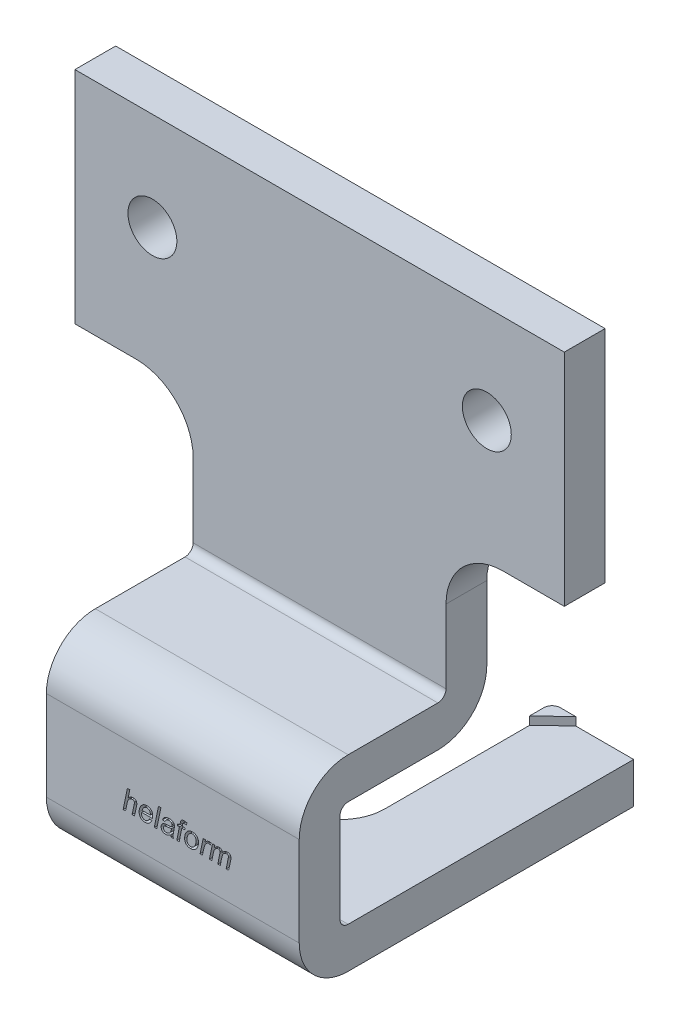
from build123d import *

# Parameters (mm, degrees)
EXTRUDE1_DEPTH     = 31
EXTRUDE2_DEPTH     = 5
SKETCH3_R          = 3
EXTRUDE3_DEPTH     = 85.191745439
EXTRUDE4_REACH     = 86.192
FILLET2_R          = 1
EXTRUDE5_START     = 1
EXTRUDE5_DEPTH     = 1
CUT_EXTRUDE1_DEPTH = 1


with BuildPart() as part:
    # Sketch1 → Extrude1 (new body)
    with BuildSketch(Plane(origin=(0, 0, 0), x_dir=(0, 0, -1), z_dir=(1, 0, 0))):
        with BuildLine():
            Line((0, 0), (0, -43))
            ThreePointArc((0, -43), (-0.292893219, -43.707106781), (-1, -44))
            Line((-1, -44), (-12, -44))
            ThreePointArc((-12, -44), (-16.242640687, -45.757359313), (-18, -50))
            Line((-18, -50), (-18, -61))
            ThreePointArc((-18, -61), (-16.242640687, -65.242640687), (-12, -67))
            Line((-12, -67), (23, -67))
            Line((23, -67), (23, -62))
            Line((23, -62), (-12, -62))
            ThreePointArc((-12, -62), (-12.707106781, -61.707106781), (-13, -61))
            Line((-13, -61), (-13, -50))
            ThreePointArc((-13, -50), (-12.707106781, -49.292893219), (-12, -49))
            Line((-12, -49), (-1, -49))
            ThreePointArc((-1, -49), (3.242640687, -47.242640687), (5, -43))
            Line((5, -43), (5, 0))
            Line((5, 0), (0, 0))
        make_face()
    extrude(amount=EXTRUDE1_DEPTH)

    # Sketch2 → Extrude2 (add)
    with BuildSketch(Plane(origin=(0, 0, -5), x_dir=(-1, 0, 0), z_dir=(0, 0, -1))):
        with BuildLine():
            Line((-45.5, 0), (14.5, 0))
            Line((14.5, 0), (14.5, -27))
            Line((14.5, -27), (7, -27))
            ThreePointArc((7, -27), (2.050252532, -29.050252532), (0, -34))
            Line((0, -34), (-31, -34))
            ThreePointArc((-31, -34), (-33.050252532, -29.050252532), (-38, -27))
            Line((-38, -27), (-45.5, -27))
            Line((-45.5, -27), (-45.5, 0))
        make_face()
    extrude(amount=-EXTRUDE2_DEPTH)

    # Sketch3 → Extrude3 (cut, through all)
    with BuildSketch(Plane.XY):
        with Locations((-5, -12)):
            Circle(SKETCH3_R)
        with Locations((36, -12)):
            Circle(SKETCH3_R)
    extrude(amount=-EXTRUDE3_DEPTH, mode=Mode.SUBTRACT)

    # Sketch4 → Extrude4 (cut, up to next)
    with BuildSketch(Plane.XZ.offset(67), mode=Mode.PRIVATE) as extrude4_sk1:
        with BuildLine():
            Line((10, -23), (10, -2.5))
            ThreePointArc((10, -2.5), (15.5, 3), (21, -2.5))
            Line((21, -2.5), (21, -23))
            Line((21, -23), (10, -23))
        make_face()
    extrude4_tool1 = extrude(extrude4_sk1.sketch, amount=-EXTRUDE4_REACH, mode=Mode.PRIVATE) & part.part
    add(extrude4_tool1.solids().sort_by_distance((15.5, -67, -10.559797))[0], mode=Mode.SUBTRACT)

    # Fillet2
    fillet2_edges = [part.edges().sort_by_distance(p)[0] for p in [
        (21, -64.5, -23),
        (10, -64.5, -23),
    ]]
    fillet(fillet2_edges, radius=FILLET2_R)

    # Sketch5 → Extrude5 (add)
    with BuildSketch(Plane(origin=(0, -62, 0), x_dir=(1, 0, 0), z_dir=(0, 1, 0)).offset(EXTRUDE5_START)):
        with BuildLine():
            Line((23.904445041, 23), (21, 20.249691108))
            Line((21, 20.249691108), (21, 22))
            ThreePointArc((21, 22), (21.292893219, 22.707106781), (22, 23))
            Line((22, 23), (23.904445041, 23))
        make_face()
        with BuildLine():
            Line((7.095554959, 23), (9, 23))
            ThreePointArc((9, 23), (9.707106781, 22.707106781), (10, 22))
            Line((10, 22), (10, 20.249691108))
            Line((10, 20.249691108), (7.095554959, 23))
        make_face()
    extrude(amount=-EXTRUDE5_DEPTH)

    # Sketch6 → Cut-Extrude1 (cut)
    # profile 1 of 8: a face of its own
    with BuildSketch(Plane.XY.offset(18)):
        with BuildLine():
            Line((9.417965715, -57.601331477), (9.930786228, -55.101331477))
            Line((9.930786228, -55.101331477), (10.224255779, -55.101331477))
            Line((10.224255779, -55.101331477), (10.024436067, -56.073887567))
            add(Edge.make_bspline(
                [(10.024436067, -56.073887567), (10.051656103, -56.046015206), (10.103501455, -55.992927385), (10.182644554, -55.922155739), (10.259408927, -55.864699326), (10.333967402, -55.818817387), (10.408201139, -55.78510923), (10.482279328, -55.759665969), (10.557924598, -55.745601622), (10.608652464, -55.743435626), (10.633911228, -55.742357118)],
                knots=[0, 0, 0, 0, 1.308535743, 2.49233682, 3.562295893, 4.525943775, 5.426764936, 6.295690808, 7.151378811, 8, 8, 8, 8], degree=3))
            add(Edge.make_bspline(
                [(10.633911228, -55.742357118), (10.651618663, -55.742775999), (10.686285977, -55.743596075), (10.736752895, -55.748977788), (10.784207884, -55.758489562), (10.828566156, -55.771943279), (10.869718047, -55.789670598), (10.90816501, -55.81047184), (10.942844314, -55.836095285), (10.975116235, -55.864393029), (11.003280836, -55.896470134), (11.028465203, -55.930738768), (11.048476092, -55.968181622), (11.066776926, -56.007265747), (11.079199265, -56.049577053), (11.089020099, -56.093872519), (11.094411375, -56.140696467), (11.095230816, -56.17270006), (11.09565001, -56.189071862)],
                knots=[0, 0, 0, 0, 1.169014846, 2.288677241, 3.345563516, 4.35999745, 5.342562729, 6.299516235, 7.238597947, 8.183095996, 9.127594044, 10.051288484, 10.983620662, 11.925801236, 12.894862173, 13.887022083, 14.91908212, 16, 16, 16, 16], degree=3))
            add(Edge.make_bspline(
                [(11.09565001, -56.189071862), (11.095382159, -56.197755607), (11.094789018, -56.216985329), (11.092239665, -56.248246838), (11.087616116, -56.284485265), (11.080882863, -56.325499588), (11.073041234, -56.371640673), (11.062753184, -56.422644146), (11.051434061, -56.478813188), (11.042646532, -56.517781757), (11.038057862, -56.538130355)],
                knots=[0, 0, 0, 0, 0.588475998, 1.303150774, 2.123698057, 3.062574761, 4.118571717, 5.294001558, 6.586982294, 8, 8, 8, 8], degree=3))
            Line((11.038057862, -56.538130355), (10.801178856, -57.601331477))
            Line((10.801178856, -57.601331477), (10.507709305, -57.601331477))
            Line((10.507709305, -57.601331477), (10.745089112, -56.479536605))
            add(Edge.make_bspline(
                [(10.745089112, -56.479536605), (10.749098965, -56.460173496), (10.756733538, -56.423307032), (10.767548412, -56.370807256), (10.775602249, -56.323751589), (10.783617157, -56.282661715), (10.788902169, -56.247034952), (10.793233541, -56.217198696), (10.795155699, -56.192931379), (10.795863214, -56.178723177), (10.796170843, -56.17254542)],
                knots=[0, 0, 0, 0, 1.523510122, 2.900692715, 4.129268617, 5.201396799, 6.125444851, 6.903953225, 7.523436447, 8, 8, 8, 8], degree=3))
            add(Edge.make_bspline(
                [(10.796170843, -56.17254542), (10.795616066, -56.158106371), (10.794532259, -56.129898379), (10.782653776, -56.089975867), (10.76350021, -56.054254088), (10.737445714, -56.02295266), (10.703753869, -55.997516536), (10.663032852, -55.979410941), (10.615799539, -55.968302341), (10.582060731, -55.967263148), (10.56429985, -55.966716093)],
                knots=[0, 0, 0, 0, 0.987245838, 1.928674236, 2.824499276, 3.750363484, 4.697752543, 5.691079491, 6.784531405, 8, 8, 8, 8], degree=3))
            add(Edge.make_bspline(
                [(10.56429985, -55.966716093), (10.537334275, -55.967929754), (10.483701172, -55.970343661), (10.404184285, -55.988166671), (10.326848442, -56.017380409), (10.252514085, -56.058032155), (10.183252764, -56.108270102), (10.12079671, -56.167597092), (10.066449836, -56.235588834), (10.028286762, -56.299665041), (10.00124057, -56.356990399), (9.980673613, -56.40634084), (9.961538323, -56.462247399), (9.9418741, -56.52377718), (9.922902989, -56.591610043), (9.90452501, -56.665623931), (9.886467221, -56.745768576), (9.875406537, -56.80135887), (9.869688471, -56.830097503)],
                knots=[0, 0, 0, 0, 1.06375668, 2.115755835, 3.200026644, 4.317463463, 5.44956746, 6.568091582, 7.707210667, 8.87448921, 9.502236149, 10.208264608, 10.983462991, 11.833661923, 12.757731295, 13.762901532, 14.843482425, 16, 16, 16, 16], degree=3))
            Line((9.869688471, -56.830097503), (9.711435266, -57.601331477))
            Line((9.711435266, -57.601331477), (9.417965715, -57.601331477))
        make_face()
    # profile 2 of 8: a face of its own
    with BuildSketch(Plane.XY.offset(18)):
        with BuildLine():
            Line((12.632108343, -56.992357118), (12.929584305, -57.0244084))
            add(Edge.make_bspline(
                [(12.929584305, -57.0244084), (12.923767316, -57.042571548), (12.912021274, -57.079247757), (12.887442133, -57.132584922), (12.857662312, -57.185024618), (12.823562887, -57.237482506), (12.783923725, -57.289086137), (12.738508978, -57.339570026), (12.68847088, -57.389685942), (12.633775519, -57.438348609), (12.575634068, -57.484453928), (12.513070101, -57.524105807), (12.447950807, -57.557570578), (12.380209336, -57.585589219), (12.309543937, -57.60690409), (12.23604901, -57.622620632), (12.159747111, -57.631667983), (12.107959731, -57.63280621), (12.081727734, -57.633382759)],
                knots=[0, 0, 0, 0, 0.821440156, 1.658705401, 2.525323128, 3.419405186, 4.353419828, 5.32681938, 6.344399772, 7.404443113, 8.481060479, 9.538977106, 10.591299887, 11.633537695, 12.694215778, 13.768160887, 14.869500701, 16, 16, 16, 16], degree=3))
            add(Edge.make_bspline(
                [(12.081727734, -57.633382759), (12.049106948, -57.632159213), (11.984586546, -57.62973917), (11.88984759, -57.612534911), (11.799367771, -57.583098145), (11.713880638, -57.542667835), (11.634699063, -57.491659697), (11.566155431, -57.427674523), (11.506135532, -57.354714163), (11.457902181, -57.270829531), (11.419834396, -57.179032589), (11.393156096, -57.080190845), (11.376023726, -56.975423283), (11.37408503, -56.903450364), (11.37309392, -56.866655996)],
                knots=[0, 0, 0, 0, 0.998551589, 1.975027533, 2.936744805, 3.903838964, 4.863557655, 5.807675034, 6.763178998, 7.745855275, 8.758641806, 9.797744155, 10.874151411, 12, 12, 12, 12], degree=3))
            add(Edge.make_bspline(
                [(11.37309392, -56.866655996), (11.373435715, -56.842101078), (11.374120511, -56.792904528), (11.381022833, -56.719525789), (11.391310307, -56.646564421), (11.406605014, -56.574408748), (11.425483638, -56.502587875), (11.449152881, -56.431604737), (11.476838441, -56.361030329), (11.508617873, -56.291661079), (11.543602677, -56.224605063), (11.582080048, -56.161886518), (11.621883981, -56.102890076), (11.664927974, -56.048818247), (11.710854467, -55.999492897), (11.758852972, -55.954459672), (11.809125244, -55.913386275), (11.862389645, -55.87755793), (11.917147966, -55.845707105), (11.973063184, -55.817774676), (12.030423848, -55.794769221), (12.088863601, -55.775890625), (12.14816809, -55.760542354), (12.20865195, -55.750248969), (12.270202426, -55.743354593), (12.311743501, -55.742690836), (12.332629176, -55.742357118)],
                knots=[0, 0, 0, 0, 1.075906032, 2.155611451, 3.227554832, 4.30373447, 5.38628686, 6.480642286, 7.581143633, 8.707391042, 9.82337293, 10.893692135, 11.930684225, 12.940768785, 13.919223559, 14.881988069, 15.823529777, 16.761054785, 17.692163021, 18.598508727, 19.497917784, 20.397951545, 21.288749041, 22.180057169, 23.084984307, 24, 24, 24, 24], degree=3))
            add(Edge.make_bspline(
                [(12.332629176, -55.742357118), (12.358869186, -55.742860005), (12.410029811, -55.743840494), (12.484810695, -55.753655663), (12.555440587, -55.769482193), (12.622117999, -55.791835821), (12.685183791, -55.819499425), (12.743446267, -55.855124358), (12.79786433, -55.896350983), (12.847937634, -55.94347077), (12.893218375, -55.99600436), (12.932021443, -56.054000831), (12.966233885, -56.115837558), (12.992998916, -56.182919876), (13.014104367, -56.254345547), (13.028995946, -56.330460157), (13.038120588, -56.411037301), (13.039206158, -56.466324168), (13.039760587, -56.494560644)],
                knots=[0, 0, 0, 0, 1.079196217, 2.10412856, 3.097265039, 4.052997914, 4.993829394, 5.924450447, 6.855882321, 7.798592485, 8.748507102, 9.702980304, 10.665060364, 11.651045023, 12.668191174, 13.725659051, 14.838433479, 16, 16, 16, 16], degree=3))
            add(Edge.make_bspline(
                [(13.039760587, -56.494560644), (13.03864883, -56.539541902), (13.036384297, -56.631164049), (13.023024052, -56.721839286), (13.016222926, -56.767998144)],
                knots=[0, 0, 0, 0, 0.981886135, 2, 2, 2, 2], degree=3))
            Line((13.016222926, -56.767998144), (11.693606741, -56.767998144))
            add(Edge.make_bspline(
                [(11.693606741, -56.767998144), (11.688751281, -56.776924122), (11.679597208, -56.793752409), (11.669200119, -56.81934153), (11.662919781, -56.843647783), (11.66199321, -56.859613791), (11.661555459, -56.867156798)],
                knots=[0, 0, 0, 0, 1.156942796, 2.181202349, 3.140724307, 4, 4, 4, 4], degree=3))
            add(Edge.make_bspline(
                [(11.661555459, -56.867156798), (11.661951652, -56.888536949), (11.662720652, -56.930035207), (11.668310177, -56.990264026), (11.67716517, -57.046719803), (11.689884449, -57.099296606), (11.70733202, -57.147661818), (11.727180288, -57.192676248), (11.751023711, -57.233941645), (11.7794498, -57.27035236), (11.809786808, -57.303101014), (11.842589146, -57.330949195), (11.876215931, -57.355549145), (11.912064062, -57.375239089), (11.949711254, -57.390035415), (11.988700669, -57.401388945), (12.029417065, -57.40799676), (12.057165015, -57.408678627), (12.071210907, -57.409023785)],
                knots=[0, 0, 0, 0, 1.346284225, 2.613098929, 3.805631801, 4.942804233, 6.013450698, 7.039235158, 8.038108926, 9.00533571, 9.942442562, 10.84439418, 11.710848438, 12.56244313, 13.41163356, 14.253504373, 15.115931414, 16, 16, 16, 16], degree=3))
            add(Edge.make_bspline(
                [(12.071210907, -57.409023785), (12.098230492, -57.407862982), (12.152717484, -57.405522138), (12.233181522, -57.383163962), (12.313406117, -57.350167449), (12.377449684, -57.310837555), (12.42789751, -57.274437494), (12.463177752, -57.242476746), (12.497232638, -57.208409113), (12.528413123, -57.170701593), (12.558295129, -57.130694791), (12.58517447, -57.087274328), (12.610507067, -57.041311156), (12.624837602, -57.008834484), (12.632108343, -56.992357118)],
                knots=[0, 0, 0, 0, 1.313044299, 2.647851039, 4.03980324, 5.527339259, 6.29475363, 7.066375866, 7.842396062, 8.63863277, 9.446691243, 10.272184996, 11.123375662, 12, 12, 12, 12], degree=3))
        make_face()
        with BuildLine():
            Line((11.742685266, -56.54363917), (12.749796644, -56.54363917))
            add(Edge.make_bspline(
                [(12.749796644, -56.54363917), (12.750156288, -56.529283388), (12.750758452, -56.505246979), (12.751143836, -56.48120618), (12.751299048, -56.471523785)],
                knots=[0, 0, 0, 0, 1.194503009, 2, 2, 2, 2], degree=3))
            add(Edge.make_bspline(
                [(12.751299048, -56.471523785), (12.75083083, -56.451818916), (12.749916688, -56.413347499), (12.745257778, -56.357372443), (12.736051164, -56.305016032), (12.723859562, -56.256084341), (12.706988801, -56.211048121), (12.687880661, -56.169010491), (12.663811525, -56.131189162), (12.63699263, -56.096777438), (12.607313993, -56.066008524), (12.575370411, -56.039493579), (12.541184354, -56.017171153), (12.505270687, -55.998404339), (12.466727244, -55.984642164), (12.426615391, -55.973805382), (12.38422278, -55.96785738), (12.355349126, -55.967101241), (12.340641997, -55.966716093)],
                knots=[0, 0, 0, 0, 1.288915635, 2.516454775, 3.668675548, 4.762204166, 5.808675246, 6.809806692, 7.776046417, 8.732555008, 9.659000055, 10.566141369, 11.441184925, 12.324901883, 13.209090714, 14.112018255, 15.038334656, 16, 16, 16, 16], degree=3))
            add(Edge.make_bspline(
                [(12.340641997, -55.966716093), (12.324416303, -55.966988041), (12.292306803, -55.967526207), (12.244807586, -55.975294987), (12.198133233, -55.985737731), (12.152932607, -56.002312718), (12.108605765, -56.022316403), (12.065270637, -56.046793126), (12.023838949, -56.076975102), (11.982647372, -56.110141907), (11.943363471, -56.148346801), (11.90713866, -56.191616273), (11.87254314, -56.238780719), (11.842079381, -56.291277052), (11.812418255, -56.347371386), (11.786977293, -56.408856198), (11.762453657, -56.474279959), (11.749376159, -56.520163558), (11.742685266, -56.54363917)],
                knots=[0, 0, 0, 0, 0.867869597, 1.717452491, 2.571772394, 3.425671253, 4.289803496, 5.174634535, 6.084973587, 7.031591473, 8.005136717, 9.013559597, 10.050697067, 11.133079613, 12.260592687, 13.446148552, 14.693362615, 16, 16, 16, 16], degree=3))
        make_face(mode=Mode.SUBTRACT)
    # profile 3 of 8: a face of its own
    with BuildSketch(Plane.XY.offset(18)):
        Polygon((13.234071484, -57.601331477), (13.744888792, -55.101331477), (14.038358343, -55.101331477), (13.527541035, -57.601331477), align=None)
    # profile 4 of 8: a face of its own
    with BuildSketch(Plane.XY.offset(18)):
        with BuildLine():
            add(Edge.make_bspline(
                [(15.251299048, -57.377974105), (15.225048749, -57.399551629), (15.174322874, -57.441247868), (15.096086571, -57.495541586), (15.019215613, -57.540012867), (14.943153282, -57.575189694), (14.8666762, -57.601761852), (14.788008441, -57.619425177), (14.707147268, -57.631705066), (14.652053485, -57.632820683), (14.624295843, -57.633382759)],
                knots=[0, 0, 0, 0, 1.176742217, 2.273927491, 3.294581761, 4.249353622, 5.172863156, 6.093035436, 7.039223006, 8, 8, 8, 8], degree=3))
            add(Edge.make_bspline(
                [(14.624295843, -57.633382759), (14.603916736, -57.63281988), (14.563889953, -57.631714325), (14.505331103, -57.625471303), (14.449889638, -57.61378993), (14.397532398, -57.597818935), (14.34822031, -57.577176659), (14.301693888, -57.552143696), (14.25874212, -57.521770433), (14.218502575, -57.487916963), (14.182684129, -57.450011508), (14.151468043, -57.409124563), (14.12464457, -57.365985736), (14.103149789, -57.319997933), (14.085920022, -57.27176328), (14.073910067, -57.220711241), (14.066934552, -57.167164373), (14.065917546, -57.130598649), (14.065401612, -57.112048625)],
                knots=[0, 0, 0, 0, 1.139245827, 2.237602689, 3.286124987, 4.301365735, 5.2925262, 6.269488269, 7.247875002, 8.227506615, 9.204290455, 10.15602149, 11.098561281, 12.037631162, 12.987851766, 13.95644656, 14.963292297, 16, 16, 16, 16], degree=3))
            add(Edge.make_bspline(
                [(14.065401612, -57.112048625), (14.066030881, -57.087606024), (14.067264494, -57.039688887), (14.08103641, -56.970493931), (14.101206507, -56.90515657), (14.131184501, -56.845153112), (14.167857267, -56.790093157), (14.209990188, -56.740088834), (14.258130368, -56.696235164), (14.311675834, -56.657790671), (14.37134901, -56.625203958), (14.436934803, -56.597904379), (14.508286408, -56.574311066), (14.558724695, -56.563986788), (14.584732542, -56.558663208)],
                knots=[0, 0, 0, 0, 1.057058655, 2.072251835, 3.043911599, 4.010610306, 4.965012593, 5.903623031, 6.834882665, 7.777798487, 8.75171468, 9.772170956, 10.851248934, 12, 12, 12, 12], degree=3))
            add(Edge.make_bspline(
                [(14.584732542, -56.558663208), (14.594568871, -56.55691061), (14.615843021, -56.553120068), (14.650805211, -56.548846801), (14.691206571, -56.544367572), (14.737265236, -56.539790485), (14.788861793, -56.535834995), (14.845978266, -56.532530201), (14.908560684, -56.528808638), (14.975033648, -56.526181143), (15.041859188, -56.523084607), (15.105464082, -56.517963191), (15.164074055, -56.511983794), (15.217596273, -56.505291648), (15.265997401, -56.496598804), (15.309305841, -56.487271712), (15.347931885, -56.47702065), (15.371383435, -56.468197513), (15.382508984, -56.464011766)],
                knots=[0, 0, 0, 0, 0.595113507, 1.287119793, 2.097608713, 3.016901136, 4.044304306, 5.180150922, 6.425203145, 7.779016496, 9.143236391, 10.410139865, 11.579789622, 12.652956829, 13.622514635, 14.508107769, 15.292237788, 16, 16, 16, 16], degree=3))
            add(Edge.make_bspline(
                [(15.382508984, -56.464011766), (15.386784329, -56.442498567), (15.394948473, -56.401417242), (15.405015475, -56.342409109), (15.409918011, -56.288814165), (15.411032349, -56.255017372), (15.411555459, -56.23915199)],
                knots=[0, 0, 0, 0, 1.159062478, 2.213330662, 3.161275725, 4, 4, 4, 4], degree=3))
            add(Edge.make_bspline(
                [(15.411555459, -56.23915199), (15.410897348, -56.22082479), (15.409635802, -56.185692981), (15.394214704, -56.136545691), (15.370782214, -56.09256573), (15.347300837, -56.069845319), (15.335433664, -56.058362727)],
                knots=[0, 0, 0, 0, 1.082179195, 2.074452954, 3.026854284, 4, 4, 4, 4], degree=3))
            add(Edge.make_bspline(
                [(15.335433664, -56.058362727), (15.326427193, -56.050941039), (15.308216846, -56.035934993), (15.277024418, -56.017516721), (15.243272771, -56.001418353), (15.206162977, -55.989066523), (15.16648206, -55.979112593), (15.123857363, -55.971387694), (15.07808747, -55.967700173), (15.046643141, -55.967050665), (15.030445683, -55.966716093)],
                knots=[0, 0, 0, 0, 0.859677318, 1.738197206, 2.663619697, 3.613780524, 4.617262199, 5.680109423, 6.804988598, 8, 8, 8, 8], degree=3))
            add(Edge.make_bspline(
                [(15.030445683, -55.966716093), (15.000293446, -55.967573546), (14.942266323, -55.96922369), (14.859713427, -55.987405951), (14.785035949, -56.015576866), (14.719855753, -56.057042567), (14.662995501, -56.10821946), (14.614931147, -56.169504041), (14.574888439, -56.240287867), (14.555938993, -56.292411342), (14.546170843, -56.319280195)],
                knots=[0, 0, 0, 0, 1.116846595, 2.149339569, 3.120005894, 4.063359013, 4.997375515, 5.94525119, 6.940808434, 8, 8, 8, 8], degree=3))
            Line((14.546170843, -56.319280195), (14.257709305, -56.287228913))
            add(Edge.make_bspline(
                [(14.257709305, -56.287228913), (14.265614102, -56.265752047), (14.281132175, -56.223590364), (14.308819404, -56.163027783), (14.34023516, -56.106655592), (14.375100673, -56.054233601), (14.412747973, -56.005381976), (14.453632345, -55.960146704), (14.498711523, -55.919446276), (14.546736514, -55.882395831), (14.597971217, -55.849047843), (14.652709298, -55.820547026), (14.710754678, -55.796512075), (14.771745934, -55.776270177), (14.836218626, -55.761558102), (14.903619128, -55.750589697), (14.974358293, -55.743169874), (15.022747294, -55.742631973), (15.047472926, -55.742357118)],
                knots=[0, 0, 0, 0, 1.062635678, 2.086082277, 3.089150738, 4.056806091, 5.007446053, 5.951423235, 6.884447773, 7.824212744, 8.766149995, 9.719820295, 10.6859836, 11.681412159, 12.700709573, 13.753541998, 14.852113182, 16, 16, 16, 16], degree=3))
            add(Edge.make_bspline(
                [(15.047472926, -55.742357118), (15.073534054, -55.742811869), (15.124433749, -55.743700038), (15.198752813, -55.751378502), (15.268970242, -55.76365359), (15.334961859, -55.781307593), (15.396933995, -55.803520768), (15.454112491, -55.832073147), (15.507892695, -55.864320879), (15.540196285, -55.890215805), (15.556287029, -55.90311433)],
                knots=[0, 0, 0, 0, 1.147245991, 2.240673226, 3.286002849, 4.282675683, 5.245377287, 6.178960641, 7.092921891, 8, 8, 8, 8], degree=3))
            add(Edge.make_bspline(
                [(15.556287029, -55.90311433), (15.567692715, -55.913236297), (15.590252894, -55.933257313), (15.619756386, -55.966797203), (15.644542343, -56.002659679), (15.664674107, -56.040703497), (15.681098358, -56.080832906), (15.691599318, -56.123730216), (15.699214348, -56.168435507), (15.69974655, -56.199053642), (15.700016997, -56.214612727)],
                knots=[0, 0, 0, 0, 1.030059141, 2.037432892, 3.010866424, 3.970002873, 4.942258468, 5.933000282, 6.949621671, 8, 8, 8, 8], degree=3))
            add(Edge.make_bspline(
                [(15.700016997, -56.214612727), (15.699681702, -56.239836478), (15.698983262, -56.292379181), (15.691155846, -56.373869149), (15.680447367, -56.461296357), (15.669916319, -56.521144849), (15.664460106, -56.552152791)],
                knots=[0, 0, 0, 0, 0.890374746, 1.854708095, 2.888508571, 4, 4, 4, 4], degree=3))
            Line((15.664460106, -56.552152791), (15.579824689, -57.003875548))
            add(Edge.make_bspline(
                [(15.579824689, -57.003875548), (15.573715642, -57.038055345), (15.562093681, -57.103079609), (15.54970802, -57.195975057), (15.541479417, -57.278835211), (15.540307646, -57.330715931), (15.539760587, -57.354937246)],
                knots=[0, 0, 0, 0, 1.17760315, 2.240293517, 3.178453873, 4, 4, 4, 4], degree=3))
            add(Edge.make_bspline(
                [(15.539760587, -57.354937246), (15.540207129, -57.370811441), (15.541187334, -57.405656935), (15.548054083, -57.462564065), (15.55712449, -57.528987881), (15.566376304, -57.576166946), (15.571311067, -57.601331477)],
                knots=[0, 0, 0, 0, 0.765813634, 1.681039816, 2.763105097, 4, 4, 4, 4], degree=3))
            Line((15.571311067, -57.601331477), (15.280345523, -57.601331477))
            add(Edge.make_bspline(
                [(15.280345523, -57.601331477), (15.277007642, -57.585670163), (15.269938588, -57.552502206), (15.262303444, -57.499462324), (15.255699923, -57.440676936), (15.252811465, -57.399522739), (15.251299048, -57.377974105)],
                knots=[0, 0, 0, 0, 0.852057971, 1.804511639, 2.850426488, 4, 4, 4, 4], degree=3))
        make_face()
        with BuildLine():
            add(Edge.make_bspline(
                [(15.344448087, -56.659825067), (15.324238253, -56.667953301), (15.283050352, -56.684518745), (15.226254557, -56.698959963), (15.171163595, -56.708021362), (15.114128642, -56.714543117), (15.041710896, -56.722270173), (14.988224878, -56.726571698), (14.9588311, -56.728935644)],
                knots=[0, 0, 0, 0, 0.995082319, 2.02799051, 2.670388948, 3.546965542, 4.651910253, 6, 6, 6, 6], degree=3))
            add(Edge.make_bspline(
                [(14.9588311, -56.728935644), (14.937619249, -56.731006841), (14.896828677, -56.73498977), (14.838123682, -56.74232411), (14.784070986, -56.748796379), (14.734770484, -56.757276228), (14.689920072, -56.764893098), (14.649676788, -56.773477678), (14.61419182, -56.782283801), (14.574017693, -56.794747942), (14.529640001, -56.812731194), (14.482926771, -56.840641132), (14.442494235, -56.873678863), (14.410521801, -56.913327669), (14.385519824, -56.956399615), (14.367335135, -57.001937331), (14.355648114, -57.049697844), (14.354463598, -57.082433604), (14.353863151, -57.099027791)],
                knots=[0, 0, 0, 0, 1.291140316, 2.482874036, 3.58428306, 4.588539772, 5.513036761, 6.340191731, 7.080974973, 7.727139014, 8.887871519, 9.971916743, 11.013029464, 12.033452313, 13.039540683, 14.019883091, 14.996252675, 16, 16, 16, 16], degree=3))
            add(Edge.make_bspline(
                [(14.353863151, -57.099027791), (14.354765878, -57.120695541), (14.3565268, -57.162962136), (14.374818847, -57.222982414), (14.403909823, -57.277002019), (14.444461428, -57.323892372), (14.495656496, -57.362752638), (14.557868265, -57.389502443), (14.629084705, -57.406364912), (14.679780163, -57.408107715), (14.706427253, -57.409023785)],
                knots=[0, 0, 0, 0, 0.980060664, 1.911773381, 2.816178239, 3.744810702, 4.701647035, 5.704679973, 6.793509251, 8, 8, 8, 8], degree=3))
            add(Edge.make_bspline(
                [(14.706427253, -57.409023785), (14.732369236, -57.407863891), (14.784373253, -57.405538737), (14.861556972, -57.389739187), (14.936654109, -57.362484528), (15.009609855, -57.326445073), (15.077203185, -57.280112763), (15.137734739, -57.225357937), (15.18808967, -57.161163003), (15.222851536, -57.101548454), (15.246736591, -57.048978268), (15.263317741, -57.004954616), (15.280218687, -56.957407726), (15.2949379, -56.905625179), (15.309069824, -56.849866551), (15.321855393, -56.790023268), (15.333997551, -56.726254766), (15.340899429, -56.682382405), (15.344448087, -56.659825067)],
                knots=[0, 0, 0, 0, 1.142235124, 2.289756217, 3.452247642, 4.652135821, 5.863229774, 7.049462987, 8.231909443, 9.44094933, 10.079113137, 10.772583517, 11.511838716, 12.300429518, 13.141924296, 14.044484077, 14.994555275, 16, 16, 16, 16], degree=3))
        make_face(mode=Mode.SUBTRACT)
    # profile 5 of 8: a face of its own
    with BuildSketch(Plane.XY.offset(18)):
        with BuildLine():
            Line((15.988478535, -57.601331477), (16.310994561, -55.998767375))
            Line((16.310994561, -55.998767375), (16.0525811, -55.998767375))
            Line((16.0525811, -55.998767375), (16.116683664, -55.7744084))
            Line((16.116683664, -55.7744084), (16.367084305, -55.7744084))
            Line((16.367084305, -55.7744084), (16.416663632, -55.526010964))
            add(Edge.make_bspline(
                [(16.416663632, -55.526010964), (16.422777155, -55.497247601), (16.43416908, -55.443650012), (16.453269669, -55.370130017), (16.473348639, -55.309634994), (16.493385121, -55.259761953), (16.51777685, -55.217911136), (16.549060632, -55.18229572), (16.586067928, -55.149924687), (16.629639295, -55.120911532), (16.681411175, -55.096972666), (16.742566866, -55.081032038), (16.812637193, -55.071072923), (16.862505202, -55.06990096), (16.888919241, -55.069280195)],
                knots=[0, 0, 0, 0, 1.429250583, 2.663262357, 3.689602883, 4.525968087, 5.271832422, 6.031341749, 6.819062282, 7.656214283, 8.567470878, 9.577289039, 10.716740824, 12, 12, 12, 12], degree=3))
            add(Edge.make_bspline(
                [(16.888919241, -55.069280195), (16.899269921, -55.069573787), (16.920986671, -55.070189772), (16.955106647, -55.071994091), (16.992305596, -55.076360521), (17.032942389, -55.081645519), (17.076738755, -55.089545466), (17.124102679, -55.097760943), (17.174462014, -55.108456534), (17.209108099, -55.11631349), (17.226960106, -55.120361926)],
                knots=[0, 0, 0, 0, 0.72558998, 1.522359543, 2.392979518, 3.349131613, 4.393312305, 5.510664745, 6.717326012, 8, 8, 8, 8], degree=3))
            Line((17.226960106, -55.120361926), (17.171371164, -55.387289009))
            add(Edge.make_bspline(
                [(17.171371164, -55.387289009), (17.146534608, -55.382717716), (17.099171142, -55.374000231), (17.03079479, -55.365128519), (16.968817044, -55.35918314), (16.92949557, -55.358203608), (16.910954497, -55.357741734)],
                knots=[0, 0, 0, 0, 1.154599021, 2.201827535, 3.152116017, 4, 4, 4, 4], degree=3))
            add(Edge.make_bspline(
                [(16.910954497, -55.357741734), (16.896872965, -55.358047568), (16.870248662, -55.358625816), (16.833061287, -55.367567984), (16.800678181, -55.38076134), (16.772333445, -55.401497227), (16.749435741, -55.434366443), (16.728872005, -55.47978339), (16.7106296, -55.540427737), (16.700297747, -55.58603358), (16.694608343, -55.611147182)],
                knots=[0, 0, 0, 0, 0.903865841, 1.708961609, 2.445191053, 3.14337528, 3.933937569, 4.991014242, 6.34305285, 8, 8, 8, 8], degree=3))
            Line((16.694608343, -55.611147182), (16.661054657, -55.7744084))
            Line((16.661054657, -55.7744084), (17.014119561, -55.7744084))
            Line((17.014119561, -55.7744084), (16.950016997, -55.998767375))
            Line((16.950016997, -55.998767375), (16.604964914, -55.998767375))
            Line((16.604964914, -55.998767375), (16.281948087, -57.601331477))
            Line((16.281948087, -57.601331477), (15.988478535, -57.601331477))
        make_face()
    # profile 6 of 8: a face of its own
    with BuildSketch(Plane.XY.offset(18)):
        with BuildLine():
            add(Edge.make_bspline(
                [(16.950016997, -56.905718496), (16.950971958, -56.862440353), (16.952843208, -56.777636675), (16.967732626, -56.653338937), (16.991647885, -56.534700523), (17.025008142, -56.421526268), (17.068936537, -56.314295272), (17.122188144, -56.212833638), (17.184787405, -56.116613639), (17.234164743, -56.058206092), (17.259011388, -56.028815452)],
                knots=[0, 0, 0, 0, 1.091636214, 2.139065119, 3.15337043, 4.142118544, 5.111151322, 6.071929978, 7.029796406, 8, 8, 8, 8], degree=3))
            add(Edge.make_bspline(
                [(17.259011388, -56.028815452), (17.280542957, -56.00591525), (17.323063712, -55.960691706), (17.395120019, -55.902631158), (17.471271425, -55.85239072), (17.553281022, -55.812435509), (17.639715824, -55.780363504), (17.731442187, -55.758904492), (17.827813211, -55.744714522), (17.893807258, -55.743155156), (17.9275811, -55.742357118)],
                knots=[0, 0, 0, 0, 1.003816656, 1.982347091, 2.950416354, 3.914638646, 4.892193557, 5.891460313, 6.920910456, 8, 8, 8, 8], degree=3))
            add(Edge.make_bspline(
                [(17.9275811, -55.742357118), (17.953988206, -55.742863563), (18.005647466, -55.743854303), (18.081246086, -55.753692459), (18.15297117, -55.769368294), (18.220588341, -55.792343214), (18.284505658, -55.820564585), (18.344090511, -55.85620385), (18.399977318, -55.897821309), (18.451196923, -55.94596934), (18.498171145, -55.998823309), (18.538069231, -56.057353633), (18.5724243, -56.119850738), (18.600737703, -56.186896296), (18.621951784, -56.258710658), (18.637429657, -56.334773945), (18.647253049, -56.415177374), (18.648233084, -56.470326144), (18.648734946, -56.498567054)],
                knots=[0, 0, 0, 0, 1.074521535, 2.102047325, 3.097891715, 4.058516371, 5.004534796, 5.936932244, 6.87884093, 7.835708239, 8.794022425, 9.751637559, 10.712718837, 11.693422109, 12.708216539, 13.755795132, 14.850774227, 16, 16, 16, 16], degree=3))
            add(Edge.make_bspline(
                [(18.648734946, -56.498567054), (18.648364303, -56.524287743), (18.647626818, -56.575465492), (18.641270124, -56.651493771), (18.631957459, -56.726248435), (18.618497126, -56.799720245), (18.600270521, -56.871662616), (18.578712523, -56.942356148), (18.553862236, -57.011796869), (18.524230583, -57.079045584), (18.491464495, -57.143841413), (18.455480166, -57.205290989), (18.415573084, -57.262388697), (18.373328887, -57.316267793), (18.326777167, -57.365546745), (18.277089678, -57.411035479), (18.224656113, -57.453505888), (18.168427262, -57.49065049), (18.110699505, -57.524049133), (18.051886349, -57.553321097), (17.992289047, -57.577882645), (17.931822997, -57.597872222), (17.870731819, -57.614332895), (17.808489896, -57.624832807), (17.745814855, -57.632520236), (17.703746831, -57.633095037), (17.682689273, -57.633382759)],
                knots=[0, 0, 0, 0, 1.113712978, 2.216010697, 3.301923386, 4.375322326, 5.448404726, 6.514107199, 7.57523888, 8.640352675, 9.694367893, 10.718505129, 11.721213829, 12.709140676, 13.680905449, 14.653046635, 15.625160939, 16.599638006, 17.568089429, 18.512164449, 19.442549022, 20.357011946, 21.268841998, 22.179295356, 23.088628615, 24, 24, 24, 24], degree=3))
            add(Edge.make_bspline(
                [(17.682689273, -57.633382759), (17.648559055, -57.632407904), (17.581360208, -57.630488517), (17.483173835, -57.612814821), (17.389562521, -57.584804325), (17.301575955, -57.545385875), (17.220979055, -57.495466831), (17.14930242, -57.436053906), (17.088616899, -57.366256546), (17.038029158, -57.288034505), (16.998123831, -57.20172159), (16.970586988, -57.108557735), (16.952754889, -57.00922925), (16.950946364, -56.940854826), (16.950016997, -56.905718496)],
                knots=[0, 0, 0, 0, 1.056399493, 2.079940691, 3.079426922, 4.07698514, 5.057020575, 6.007752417, 6.949498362, 7.910468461, 8.884496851, 9.883983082, 10.912618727, 12, 12, 12, 12], degree=3))
        make_face()
        with BuildLine():
            add(Edge.make_bspline(
                [(17.238478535, -56.879176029), (17.238820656, -56.9002278), (17.239484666, -56.941086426), (17.245827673, -57.00045194), (17.254890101, -57.055980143), (17.268568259, -57.107597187), (17.28596377, -57.155314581), (17.307521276, -57.199219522), (17.333233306, -57.238910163), (17.362322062, -57.274847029), (17.395009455, -57.305898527), (17.429049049, -57.334076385), (17.466062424, -57.357127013), (17.504974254, -57.376167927), (17.546153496, -57.390866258), (17.589302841, -57.401211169), (17.634561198, -57.408066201), (17.665469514, -57.408700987), (17.681186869, -57.409023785)],
                knots=[0, 0, 0, 0, 1.295111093, 2.513634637, 3.670576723, 4.754563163, 5.794674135, 6.791678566, 7.757713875, 8.699574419, 9.629537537, 10.528041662, 11.414483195, 12.305852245, 13.189730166, 14.099209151, 15.033418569, 16, 16, 16, 16], degree=3))
            add(Edge.make_bspline(
                [(17.681186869, -57.409023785), (17.697904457, -57.408524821), (17.731505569, -57.407521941), (17.781914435, -57.399846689), (17.831879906, -57.386513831), (17.881734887, -57.369220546), (17.930415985, -57.346038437), (17.977435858, -57.317358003), (18.022891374, -57.283693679), (18.065543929, -57.244363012), (18.106639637, -57.201590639), (18.144285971, -57.155113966), (18.179407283, -57.106132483), (18.221275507, -57.036290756), (18.267148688, -56.942908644), (18.293405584, -56.863670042), (18.30668767, -56.823587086)],
                knots=[0, 0, 0, 0, 0.76417638, 1.535937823, 2.324535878, 3.125956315, 3.945310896, 4.784335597, 5.640677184, 6.526804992, 7.433724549, 8.350386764, 9.258910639, 10.186940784, 12.071158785, 14, 14, 14, 14], degree=3))
            add(Edge.make_bspline(
                [(18.30668767, -56.823587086), (18.315002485, -56.795324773), (18.331342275, -56.739785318), (18.347417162, -56.655943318), (18.358104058, -56.573962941), (18.359556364, -56.519799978), (18.360273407, -56.49305824)],
                knots=[0, 0, 0, 0, 1.051458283, 2.066264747, 3.045261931, 4, 4, 4, 4], degree=3))
            add(Edge.make_bspline(
                [(18.360273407, -56.49305824), (18.359922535, -56.472840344), (18.359236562, -56.433313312), (18.352934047, -56.37595428), (18.343936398, -56.321836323), (18.329399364, -56.271614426), (18.312508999, -56.224226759), (18.289805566, -56.18101976), (18.264677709, -56.140605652), (18.234696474, -56.104615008), (18.202432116, -56.072155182), (18.167743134, -56.043830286), (18.130910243, -56.020412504), (18.092473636, -56.000191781), (18.051367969, -55.985643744), (18.008541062, -55.974353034), (17.963679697, -55.967720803), (17.933111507, -55.967054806), (17.917565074, -55.966716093)],
                knots=[0, 0, 0, 0, 1.253550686, 2.450756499, 3.575994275, 4.651243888, 5.689823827, 6.690069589, 7.672416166, 8.636253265, 9.588057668, 10.508190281, 11.407164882, 12.291652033, 13.195740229, 14.104854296, 15.036162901, 16, 16, 16, 16], degree=3))
            add(Edge.make_bspline(
                [(17.917565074, -55.966716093), (17.893468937, -55.967602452), (17.845920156, -55.969351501), (17.776292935, -55.982638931), (17.709895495, -56.004845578), (17.647151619, -56.036280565), (17.587402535, -56.075728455), (17.531224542, -56.123937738), (17.477556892, -56.179759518), (17.427070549, -56.243081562), (17.382005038, -56.313563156), (17.341666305, -56.389588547), (17.309762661, -56.472046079), (17.283510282, -56.557981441), (17.264418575, -56.6440792), (17.2493119, -56.726695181), (17.24056079, -56.804533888), (17.239154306, -56.854951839), (17.238478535, -56.879176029)],
                knots=[0, 0, 0, 0, 0.919050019, 1.813556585, 2.693819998, 3.582615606, 4.483630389, 5.419133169, 6.401208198, 7.434815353, 8.503776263, 9.589310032, 10.713026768, 11.871659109, 13.015133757, 14.075998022, 15.075579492, 16, 16, 16, 16], degree=3))
        make_face(mode=Mode.SUBTRACT)
    # profile 7 of 8: a face of its own
    with BuildSketch(Plane.XY.offset(18)):
        with BuildLine():
            Line((18.841042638, -57.601331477), (19.225658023, -55.7744084))
            Line((19.225658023, -55.7744084), (19.519127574, -55.7744084))
            Line((19.519127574, -55.7744084), (19.43148735, -56.088410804))
            add(Edge.make_bspline(
                [(19.43148735, -56.088410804), (19.455869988, -56.060569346), (19.502421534, -56.007414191), (19.574169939, -55.935933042), (19.643745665, -55.875841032), (19.711750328, -55.826983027), (19.779229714, -55.788914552), (19.847219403, -55.762010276), (19.916179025, -55.745843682), (19.962422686, -55.743513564), (19.985373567, -55.742357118)],
                knots=[0, 0, 0, 0, 1.317415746, 2.515221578, 3.602797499, 4.587383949, 5.492011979, 6.354026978, 7.183098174, 8, 8, 8, 8], degree=3))
            add(Edge.make_bspline(
                [(19.985373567, -55.742357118), (20.001582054, -55.742784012), (20.035766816, -55.74368436), (20.089433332, -55.750183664), (20.148265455, -55.760211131), (20.188908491, -55.76952273), (20.210233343, -55.7744084)],
                knots=[0, 0, 0, 0, 0.854454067, 1.802099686, 2.846791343, 4, 4, 4, 4], degree=3))
            Line((20.210233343, -55.7744084), (20.085033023, -56.062869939))
            add(Edge.make_bspline(
                [(20.085033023, -56.062869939), (20.07204743, -56.048265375), (20.047483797, -56.020639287), (20.004107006, -55.990054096), (19.958621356, -55.970139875), (19.926970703, -55.967852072), (19.911254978, -55.966716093)],
                knots=[0, 0, 0, 0, 1.139610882, 2.155695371, 3.084234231, 4, 4, 4, 4], degree=3))
            add(Edge.make_bspline(
                [(19.911254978, -55.966716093), (19.897677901, -55.96727347), (19.870030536, -55.968408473), (19.828784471, -55.978600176), (19.787072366, -55.994362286), (19.745075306, -56.016714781), (19.702426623, -56.045006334), (19.659151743, -56.079291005), (19.61568955, -56.120199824), (19.571235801, -56.167213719), (19.527866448, -56.222725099), (19.486696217, -56.287993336), (19.448063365, -56.36327931), (19.41105142, -56.448282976), (19.375995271, -56.543051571), (19.344069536, -56.647955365), (19.312452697, -56.762324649), (19.294881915, -56.84252253), (19.285754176, -56.884184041)],
                knots=[0, 0, 0, 0, 0.549463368, 1.118886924, 1.711931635, 2.353427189, 3.042026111, 3.783708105, 4.587857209, 5.458936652, 6.403515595, 7.437581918, 8.58132111, 9.829397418, 11.192852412, 12.673529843, 14.271952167, 16, 16, 16, 16], degree=3))
            Line((19.285754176, -56.884184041), (19.135012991, -57.601331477))
            Line((19.135012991, -57.601331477), (18.841042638, -57.601331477))
        make_face()
    # profile 8 of 8: a face of its own
    with BuildSketch(Plane.XY.offset(18)):
        with BuildLine():
            Line((19.994888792, -57.601331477), (20.362977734, -55.7744084))
            Line((20.362977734, -55.7744084), (20.656447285, -55.7744084))
            Line((20.656447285, -55.7744084), (20.590341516, -56.100430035))
            add(Edge.make_bspline(
                [(20.590341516, -56.100430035), (20.604089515, -56.083977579), (20.630648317, -56.052194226), (20.671074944, -56.00742775), (20.709937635, -55.966299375), (20.74799163, -55.92916663), (20.784976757, -55.896140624), (20.820760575, -55.866945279), (20.854981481, -55.841119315), (20.899758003, -55.813438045), (20.955829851, -55.784308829), (21.026767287, -55.760382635), (21.100352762, -55.745268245), (21.150498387, -55.743332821), (21.175778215, -55.742357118)],
                knots=[0, 0, 0, 0, 1.084132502, 2.094360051, 3.049733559, 3.945196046, 4.782250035, 5.556179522, 6.280499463, 6.948038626, 8.216550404, 9.465929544, 10.722503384, 12, 12, 12, 12], degree=3))
            add(Edge.make_bspline(
                [(21.175778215, -55.742357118), (21.202072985, -55.743355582), (21.253049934, -55.745291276), (21.326253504, -55.76195395), (21.392363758, -55.7905342), (21.451547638, -55.829294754), (21.502661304, -55.878263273), (21.54399854, -55.936865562), (21.576362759, -56.004043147), (21.588947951, -56.053067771), (21.595449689, -56.078394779)],
                knots=[0, 0, 0, 0, 1.075592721, 2.085222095, 3.052587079, 4.009808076, 4.966833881, 5.932096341, 6.931683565, 8, 8, 8, 8], degree=3))
            add(Edge.make_bspline(
                [(21.595449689, -56.078394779), (21.617719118, -56.05163381), (21.6608368, -55.999819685), (21.730649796, -55.930754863), (21.802546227, -55.872789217), (21.876058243, -55.825089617), (21.951804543, -55.787875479), (22.029863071, -55.762097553), (22.109692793, -55.744915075), (22.163771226, -55.743211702), (22.190902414, -55.742357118)],
                knots=[0, 0, 0, 0, 1.178955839, 2.282673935, 3.320441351, 4.302439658, 5.245851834, 6.17043085, 7.082103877, 8, 8, 8, 8], degree=3))
            add(Edge.make_bspline(
                [(22.190902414, -55.742357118), (22.208773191, -55.742815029), (22.243417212, -55.743702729), (22.293725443, -55.748440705), (22.340470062, -55.757512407), (22.383739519, -55.770004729), (22.423779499, -55.785833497), (22.459818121, -55.806356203), (22.493453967, -55.828972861), (22.522338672, -55.856693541), (22.548752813, -55.886475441), (22.570565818, -55.920054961), (22.589951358, -55.955720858), (22.605400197, -55.994577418), (22.617469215, -56.0363463), (22.62566135, -56.08115545), (22.631579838, -56.128652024), (22.631929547, -56.161341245), (22.632108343, -56.178054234)],
                knots=[0, 0, 0, 0, 1.211510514, 2.348616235, 3.420404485, 4.433742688, 5.398144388, 6.330073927, 7.240321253, 8.136965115, 9.035320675, 9.932820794, 10.843981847, 11.783163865, 12.760750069, 13.785957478, 14.868028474, 16, 16, 16, 16], degree=3))
            add(Edge.make_bspline(
                [(22.632108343, -56.178054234), (22.631499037, -56.194097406), (22.63011063, -56.230654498), (22.621807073, -56.292155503), (22.60857342, -56.366875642), (22.597522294, -56.42113491), (22.591543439, -56.450490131)],
                knots=[0, 0, 0, 0, 0.698199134, 1.590965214, 2.696669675, 4, 4, 4, 4], degree=3))
            Line((22.591543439, -56.450490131), (22.339640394, -57.601331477))
            Line((22.339640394, -57.601331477), (22.046170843, -57.601331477))
            Line((22.046170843, -57.601331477), (22.289560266, -56.376872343))
            add(Edge.make_bspline(
                [(22.289560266, -56.376872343), (22.29439343, -56.353697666), (22.303306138, -56.310961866), (22.313321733, -56.251843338), (22.319991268, -56.203408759), (22.321120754, -56.174562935), (22.321611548, -56.162028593)],
                knots=[0, 0, 0, 0, 1.305873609, 2.408126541, 3.308285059, 4, 4, 4, 4], degree=3))
            add(Edge.make_bspline(
                [(22.321611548, -56.162028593), (22.320947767, -56.147619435), (22.319679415, -56.120086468), (22.309802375, -56.08091914), (22.291632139, -56.047148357), (22.267355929, -56.018180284), (22.23682737, -55.994801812), (22.200447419, -55.978038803), (22.158473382, -55.968736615), (22.128849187, -55.967412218), (22.113278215, -55.966716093)],
                knots=[0, 0, 0, 0, 1.069480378, 2.043559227, 2.969528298, 3.893171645, 4.83027303, 5.800717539, 6.844020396, 8, 8, 8, 8], degree=3))
            add(Edge.make_bspline(
                [(22.113278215, -55.966716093), (22.090815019, -55.967816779), (22.045132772, -55.970055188), (21.976672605, -55.987533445), (21.908052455, -56.016248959), (21.840219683, -56.054866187), (21.775264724, -56.101779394), (21.717571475, -56.157392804), (21.666814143, -56.219321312), (21.631659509, -56.277334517), (21.606499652, -56.328202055), (21.588569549, -56.371630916), (21.571085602, -56.419768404), (21.554128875, -56.472915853), (21.537733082, -56.530906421), (21.52171693, -56.593695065), (21.506111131, -56.661107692), (21.496982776, -56.707871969), (21.492284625, -56.731940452)],
                knots=[0, 0, 0, 0, 1.002413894, 2.038557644, 3.13511723, 4.316968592, 5.517416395, 6.703891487, 7.885766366, 9.083896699, 9.724082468, 10.419176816, 11.181001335, 12.010956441, 12.910124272, 13.872130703, 14.904835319, 16, 16, 16, 16], degree=3))
            Line((21.492284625, -56.731940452), (21.313999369, -57.601331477))
            Line((21.313999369, -57.601331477), (21.020529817, -57.601331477))
            Line((21.020529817, -57.601331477), (21.268927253, -56.350329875))
            add(Edge.make_bspline(
                [(21.268927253, -56.350329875), (21.273077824, -56.330658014), (21.280724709, -56.294415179), (21.289176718, -56.244472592), (21.294855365, -56.203724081), (21.295631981, -56.179569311), (21.295970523, -56.169039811)],
                knots=[0, 0, 0, 0, 1.314093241, 2.421045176, 3.311705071, 4, 4, 4, 4], degree=3))
            add(Edge.make_bspline(
                [(21.295970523, -56.169039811), (21.295294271, -56.154627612), (21.293986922, -56.126765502), (21.284048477, -56.087116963), (21.266520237, -56.051973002), (21.242321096, -56.022112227), (21.213307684, -55.99720516), (21.179436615, -55.979395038), (21.141549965, -55.968522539), (21.11492224, -55.967331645), (21.101158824, -55.966716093)],
                knots=[0, 0, 0, 0, 1.096501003, 2.119789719, 3.085930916, 4.062380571, 5.027267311, 5.976631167, 6.954155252, 8, 8, 8, 8], degree=3))
            add(Edge.make_bspline(
                [(21.101158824, -55.966716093), (21.079360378, -55.967821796), (21.034828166, -55.970080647), (20.967607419, -55.987780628), (20.899490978, -56.016447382), (20.830481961, -56.054392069), (20.764366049, -56.102833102), (20.703097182, -56.160090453), (20.649568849, -56.227195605), (20.609774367, -56.289140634), (20.581488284, -56.34408821), (20.560875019, -56.38986968), (20.541547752, -56.439923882), (20.522901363, -56.494188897), (20.50571354, -56.5527997), (20.488421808, -56.615267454), (20.473014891, -56.682153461), (20.463850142, -56.728242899), (20.45913158, -56.751972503)],
                knots=[0, 0, 0, 0, 0.949721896, 1.940194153, 3.010855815, 4.167592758, 5.365912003, 6.576090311, 7.813033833, 9.099392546, 9.779864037, 10.506433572, 11.287789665, 12.118837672, 13.007836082, 13.950838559, 14.94496891, 16, 16, 16, 16], degree=3))
            Line((20.45913158, -56.751972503), (20.287857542, -57.601331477))
            Line((20.287857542, -57.601331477), (19.994888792, -57.601331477))
        make_face()
    extrude(amount=-CUT_EXTRUDE1_DEPTH, mode=Mode.SUBTRACT)


solid = part.part
